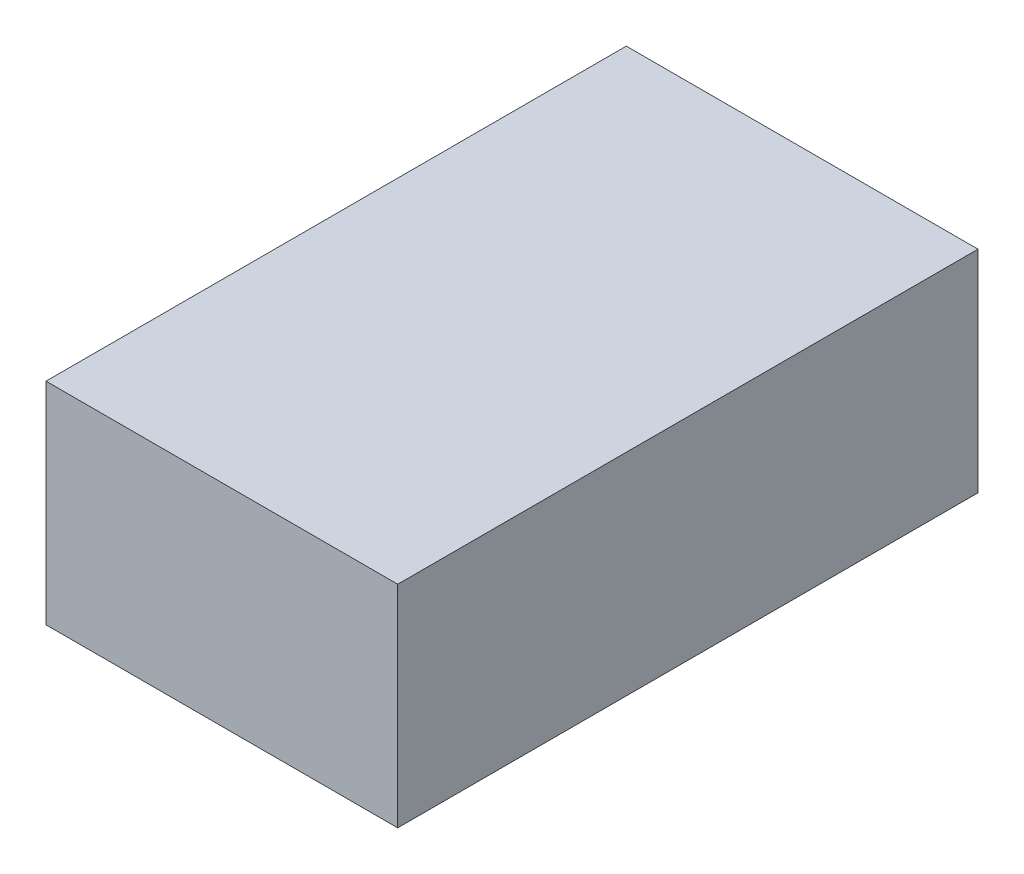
from build123d import *

# Parameters (mm, degrees)
SKETCH1_W            = 38.1
SKETCH1_H            = 104.775
PANEL_OR_BLOCK_DEPTH = 63.5


with BuildPart() as part:
    # Sketch1 → Panel_or_block (new body)
    with BuildSketch(Plane.YZ):
        with Locations((0, 52.3875)):
            Rectangle(SKETCH1_W, SKETCH1_H)
    extrude(amount=PANEL_OR_BLOCK_DEPTH)


solid = part.part
